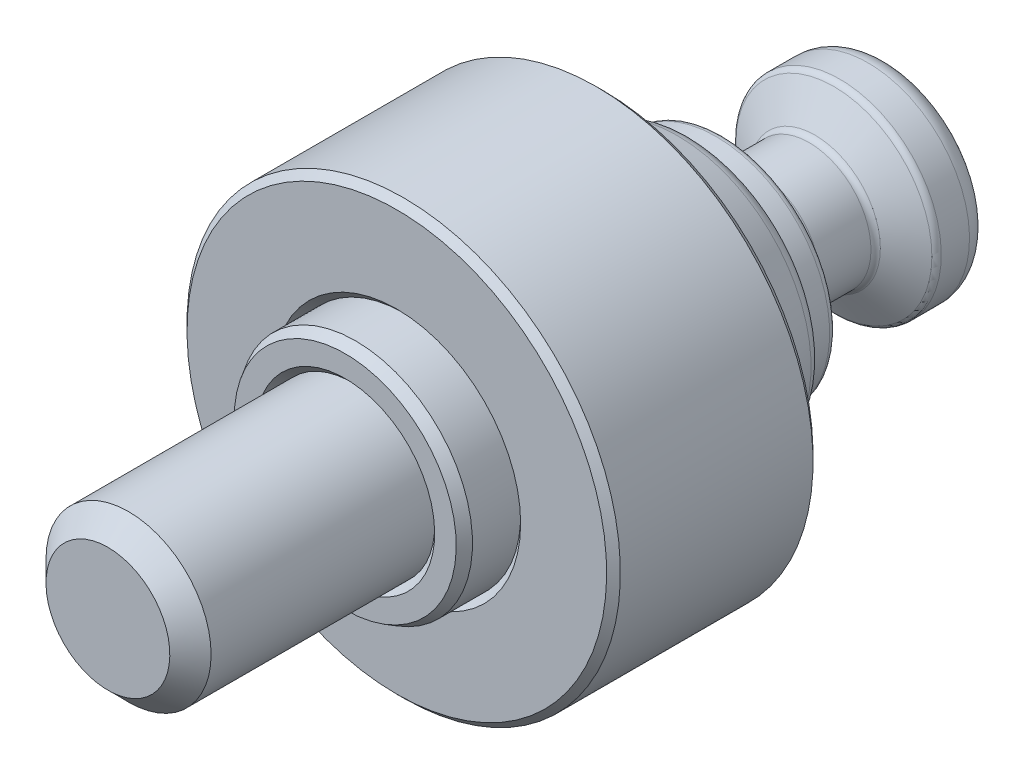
ISO-10303-21;
HEADER;
FILE_DESCRIPTION(('STEP AP214'),'2;1');
FILE_NAME('part.step','',(''),(''),'','','');
FILE_SCHEMA(('AUTOMOTIVE_DESIGN { 1 0 10303 214 1 1 1 1 }'));
ENDSEC;
DATA;
#1=APPLICATION_CONTEXT('core data for automotive mechanical design processes');
#2=APPLICATION_PROTOCOL_DEFINITION('international standard','automotive_design',2000,#1);
#3=PRODUCT_CONTEXT('',#1,'mechanical');
#4=PRODUCT('Part','Part','',(#3));
#5=PRODUCT_RELATED_PRODUCT_CATEGORY('part','',(#4));
#6=PRODUCT_DEFINITION_FORMATION('','',#4);
#7=PRODUCT_DEFINITION_CONTEXT('part definition',#1,'design');
#8=PRODUCT_DEFINITION('design','',#6,#7);
#9=PRODUCT_DEFINITION_SHAPE('','',#8);
#10=(LENGTH_UNIT() NAMED_UNIT(*) SI_UNIT(.MILLI.,.METRE.));
#11=(NAMED_UNIT(*) PLANE_ANGLE_UNIT() SI_UNIT($,.RADIAN.));
#12=(NAMED_UNIT(*) SI_UNIT($,.STERADIAN.) SOLID_ANGLE_UNIT());
#13=UNCERTAINTY_MEASURE_WITH_UNIT(LENGTH_MEASURE(1.E-05),#10,'distance_accuracy_value','');
#14=(GEOMETRIC_REPRESENTATION_CONTEXT(3) GLOBAL_UNCERTAINTY_ASSIGNED_CONTEXT((#13)) GLOBAL_UNIT_ASSIGNED_CONTEXT((#10,
#11,#12)) REPRESENTATION_CONTEXT('',''));
#15=CARTESIAN_POINT('',(0.,0.,0.));
#16=DIRECTION('',(0.,0.,1.));
#17=DIRECTION('',(1.,0.,0.));
#18=AXIS2_PLACEMENT_3D('',#15,#16,#17);
#19=CARTESIAN_POINT('',(0.,0.,-12.8632009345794));
#20=DIRECTION('',(0.,0.,-1.));
#21=DIRECTION('',(0.,1.,0.));
#22=AXIS2_PLACEMENT_3D('',#19,#20,#21);
#23=CYLINDRICAL_SURFACE('',#22,31.5);
#24=CARTESIAN_POINT('',(0.,0.,1.00000000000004));
#25=DIRECTION('',(0.,0.,-1.));
#26=DIRECTION('',(0.,1.,0.));
#27=AXIS2_PLACEMENT_3D('',#24,#25,#26);
#28=CIRCLE('',#27,31.5);
#29=CARTESIAN_POINT('',(0.,31.5,1.00000000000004));
#30=VERTEX_POINT('',#29);
#31=EDGE_CURVE('E421',#30,#30,#28,.F.);
#32=ORIENTED_EDGE('',*,*,#31,.T.);
#33=EDGE_LOOP('',(#32));
#34=FACE_BOUND('',#33,.T.);
#35=CARTESIAN_POINT('',(0.,0.,29.));
#36=DIRECTION('',(0.,0.,1.));
#37=DIRECTION('',(0.,-1.,0.));
#38=AXIS2_PLACEMENT_3D('',#35,#36,#37);
#39=CIRCLE('',#38,31.5);
#40=CARTESIAN_POINT('',(0.,-31.5,29.));
#41=VERTEX_POINT('',#40);
#42=EDGE_CURVE('E417',#41,#41,#39,.F.);
#43=ORIENTED_EDGE('',*,*,#42,.T.);
#44=EDGE_LOOP('',(#43));
#45=FACE_BOUND('',#44,.T.);
#46=ADVANCED_FACE('F14',(#34,#45),#23,.T.);
#47=CARTESIAN_POINT('',(0.,0.,0.));
#48=DIRECTION('',(0.,0.,1.));
#49=DIRECTION('',(0.,-1.,0.));
#50=AXIS2_PLACEMENT_3D('',#47,#48,#49);
#51=CONICAL_SURFACE('',#50,30.5,0.785398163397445);
#52=ORIENTED_EDGE('',*,*,#31,.F.);
#53=EDGE_LOOP('',(#52));
#54=FACE_BOUND('',#53,.T.);
#55=CARTESIAN_POINT('',(0.,0.,0.));
#56=DIRECTION('',(0.,0.,-1.));
#57=DIRECTION('',(0.,1.,0.));
#58=AXIS2_PLACEMENT_3D('',#55,#56,#57);
#59=CIRCLE('',#58,30.5);
#60=CARTESIAN_POINT('',(0.,30.5,0.));
#61=VERTEX_POINT('',#60);
#62=EDGE_CURVE('E376',#61,#61,#59,.T.);
#63=ORIENTED_EDGE('',*,*,#62,.F.);
#64=EDGE_LOOP('',(#63));
#65=FACE_BOUND('',#64,.T.);
#66=ADVANCED_FACE('F313',(#54,#65),#51,.T.);
#67=CARTESIAN_POINT('',(17.,0.,0.));
#68=DIRECTION('',(0.,0.,-1.));
#69=DIRECTION('',(0.,1.,0.));
#70=AXIS2_PLACEMENT_3D('',#67,#68,#69);
#71=PLANE('',#70);
#72=ORIENTED_EDGE('',*,*,#62,.T.);
#73=EDGE_LOOP('',(#72));
#74=FACE_BOUND('',#73,.T.);
#75=CARTESIAN_POINT('',(0.,0.,0.));
#76=DIRECTION('',(0.,0.,1.));
#77=DIRECTION('',(0.,-1.,0.));
#78=AXIS2_PLACEMENT_3D('',#75,#76,#77);
#79=CIRCLE('',#78,21.9);
#80=CARTESIAN_POINT('',(0.,-21.9,0.));
#81=VERTEX_POINT('',#80);
#82=EDGE_CURVE('E9',#81,#81,#79,.T.);
#83=ORIENTED_EDGE('',*,*,#82,.T.);
#84=EDGE_LOOP('',(#83));
#85=FACE_BOUND('',#84,.T.);
#86=ADVANCED_FACE('F320',(#74,#85),#71,.T.);
#87=CARTESIAN_POINT('',(0.,0.,29.));
#88=DIRECTION('',(0.,0.,-1.));
#89=DIRECTION('',(0.,1.,0.));
#90=AXIS2_PLACEMENT_3D('',#87,#88,#89);
#91=CONICAL_SURFACE('',#90,31.5,0.785398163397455);
#92=CARTESIAN_POINT('',(0.,0.,30.));
#93=DIRECTION('',(0.,0.,1.));
#94=DIRECTION('',(0.,-1.,0.));
#95=AXIS2_PLACEMENT_3D('',#92,#93,#94);
#96=CIRCLE('',#95,30.5);
#97=CARTESIAN_POINT('',(0.,-30.5,30.));
#98=VERTEX_POINT('',#97);
#99=EDGE_CURVE('E427',#98,#98,#96,.T.);
#100=ORIENTED_EDGE('',*,*,#99,.F.);
#101=EDGE_LOOP('',(#100));
#102=FACE_BOUND('',#101,.T.);
#103=ORIENTED_EDGE('',*,*,#42,.F.);
#104=EDGE_LOOP('',(#103));
#105=FACE_BOUND('',#104,.T.);
#106=ADVANCED_FACE('F329',(#102,#105),#91,.T.);
#107=CARTESIAN_POINT('',(17.,0.,30.));
#108=DIRECTION('',(0.,0.,1.));
#109=DIRECTION('',(0.,-1.,0.));
#110=AXIS2_PLACEMENT_3D('',#107,#108,#109);
#111=PLANE('',#110);
#112=ORIENTED_EDGE('',*,*,#99,.T.);
#113=EDGE_LOOP('',(#112));
#114=FACE_BOUND('',#113,.T.);
#115=CARTESIAN_POINT('',(0.,0.,30.));
#116=DIRECTION('',(0.,0.,1.));
#117=DIRECTION('',(0.,-1.,0.));
#118=AXIS2_PLACEMENT_3D('',#115,#116,#117);
#119=CIRCLE('',#118,18.);
#120=CARTESIAN_POINT('',(0.,-18.,30.));
#121=VERTEX_POINT('',#120);
#122=EDGE_CURVE('E425',#121,#121,#119,.F.);
#123=ORIENTED_EDGE('',*,*,#122,.T.);
#124=EDGE_LOOP('',(#123));
#125=FACE_BOUND('',#124,.T.);
#126=ADVANCED_FACE('F327',(#114,#125),#111,.T.);
#127=CARTESIAN_POINT('',(0.,0.,30.));
#128=DIRECTION('',(0.,0.,1.));
#129=DIRECTION('',(0.,-1.,0.));
#130=AXIS2_PLACEMENT_3D('',#127,#128,#129);
#131=CONICAL_SURFACE('',#130,18.,0.785398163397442);
#132=CARTESIAN_POINT('',(0.,0.,29.));
#133=DIRECTION('',(0.,0.,1.));
#134=DIRECTION('',(0.,-1.,0.));
#135=AXIS2_PLACEMENT_3D('',#132,#133,#134);
#136=CIRCLE('',#135,17.);
#137=CARTESIAN_POINT('',(0.,-17.,29.));
#138=VERTEX_POINT('',#137);
#139=EDGE_CURVE('E29',#138,#138,#136,.T.);
#140=ORIENTED_EDGE('',*,*,#139,.F.);
#141=EDGE_LOOP('',(#140));
#142=FACE_BOUND('',#141,.T.);
#143=ORIENTED_EDGE('',*,*,#122,.F.);
#144=EDGE_LOOP('',(#143));
#145=FACE_BOUND('',#144,.T.);
#146=ADVANCED_FACE('F194',(#142,#145),#131,.F.);
#147=CARTESIAN_POINT('',(0.,0.,72.));
#148=DIRECTION('',(0.,0.,1.));
#149=DIRECTION('',(0.,1.,0.));
#150=AXIS2_PLACEMENT_3D('',#147,#148,#149);
#151=PLANE('',#150);
#152=CARTESIAN_POINT('',(0.,0.,72.));
#153=DIRECTION('',(0.,0.,1.));
#154=DIRECTION('',(0.,1.,0.));
#155=AXIS2_PLACEMENT_3D('',#152,#153,#154);
#156=CIRCLE('',#155,9.);
#157=CARTESIAN_POINT('',(0.,9.,72.));
#158=VERTEX_POINT('',#157);
#159=EDGE_CURVE('E129',#158,#158,#156,.T.);
#160=ORIENTED_EDGE('',*,*,#159,.T.);
#161=EDGE_LOOP('',(#160));
#162=FACE_BOUND('',#161,.T.);
#163=ADVANCED_FACE('F184',(#162),#151,.T.);
#164=CARTESIAN_POINT('',(0.,0.,69.));
#165=DIRECTION('',(0.,0.,-1.));
#166=DIRECTION('',(0.,-1.,0.));
#167=AXIS2_PLACEMENT_3D('',#164,#165,#166);
#168=CONICAL_SURFACE('',#167,12.,0.785398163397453);
#169=ORIENTED_EDGE('',*,*,#159,.F.);
#170=EDGE_LOOP('',(#169));
#171=FACE_BOUND('',#170,.T.);
#172=CARTESIAN_POINT('',(0.,0.,69.));
#173=DIRECTION('',(0.,0.,1.));
#174=DIRECTION('',(0.,1.,0.));
#175=AXIS2_PLACEMENT_3D('',#172,#173,#174);
#176=CIRCLE('',#175,12.);
#177=CARTESIAN_POINT('',(0.,12.,69.));
#178=VERTEX_POINT('',#177);
#179=EDGE_CURVE('E126',#178,#178,#176,.F.);
#180=ORIENTED_EDGE('',*,*,#179,.F.);
#181=EDGE_LOOP('',(#180));
#182=FACE_BOUND('',#181,.T.);
#183=ADVANCED_FACE('F181',(#171,#182),#168,.T.);
#184=CARTESIAN_POINT('',(0.,0.,-13.));
#185=DIRECTION('',(0.,0.,-1.));
#186=DIRECTION('',(0.,-1.,0.));
#187=AXIS2_PLACEMENT_3D('',#184,#185,#186);
#188=CYLINDRICAL_SURFACE('',#187,12.);
#189=ORIENTED_EDGE('',*,*,#179,.T.);
#190=EDGE_LOOP('',(#189));
#191=FACE_BOUND('',#190,.T.);
#192=CARTESIAN_POINT('',(0.,0.,36.5));
#193=DIRECTION('',(0.,0.,1.));
#194=DIRECTION('',(0.,-1.,0.));
#195=AXIS2_PLACEMENT_3D('',#192,#193,#194);
#196=CIRCLE('',#195,12.);
#197=CARTESIAN_POINT('',(0.,-12.,36.5));
#198=VERTEX_POINT('',#197);
#199=EDGE_CURVE('E371',#198,#198,#196,.T.);
#200=ORIENTED_EDGE('',*,*,#199,.T.);
#201=EDGE_LOOP('',(#200));
#202=FACE_BOUND('',#201,.T.);
#203=ADVANCED_FACE('F170',(#191,#202),#188,.T.);
#204=CARTESIAN_POINT('',(0.,0.,37.5));
#205=DIRECTION('',(0.,0.,1.));
#206=DIRECTION('',(0.,-1.,0.));
#207=AXIS2_PLACEMENT_3D('',#204,#205,#206);
#208=CONICAL_SURFACE('',#207,13.,0.785398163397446);
#209=ORIENTED_EDGE('',*,*,#199,.F.);
#210=EDGE_LOOP('',(#209));
#211=FACE_BOUND('',#210,.T.);
#212=CARTESIAN_POINT('',(0.,0.,37.5));
#213=DIRECTION('',(0.,0.,1.));
#214=DIRECTION('',(0.,-1.,0.));
#215=AXIS2_PLACEMENT_3D('',#212,#213,#214);
#216=CIRCLE('',#215,13.);
#217=CARTESIAN_POINT('',(0.,-13.,37.5));
#218=VERTEX_POINT('',#217);
#219=EDGE_CURVE('E368',#218,#218,#216,.F.);
#220=ORIENTED_EDGE('',*,*,#219,.F.);
#221=EDGE_LOOP('',(#220));
#222=FACE_BOUND('',#221,.T.);
#223=ADVANCED_FACE('F167',(#211,#222),#208,.F.);
#224=CARTESIAN_POINT('',(12.,0.,37.5));
#225=DIRECTION('',(0.,0.,1.));
#226=DIRECTION('',(0.,-1.,0.));
#227=AXIS2_PLACEMENT_3D('',#224,#225,#226);
#228=PLANE('',#227);
#229=ORIENTED_EDGE('',*,*,#219,.T.);
#230=EDGE_LOOP('',(#229));
#231=FACE_BOUND('',#230,.T.);
#232=CARTESIAN_POINT('',(0.,0.,37.5));
#233=DIRECTION('',(0.,0.,1.));
#234=DIRECTION('',(0.,-1.,0.));
#235=AXIS2_PLACEMENT_3D('',#232,#233,#234);
#236=CIRCLE('',#235,16.1339745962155);
#237=CARTESIAN_POINT('',(0.,-16.1339745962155,37.5));
#238=VERTEX_POINT('',#237);
#239=EDGE_CURVE('E365',#238,#238,#236,.T.);
#240=ORIENTED_EDGE('',*,*,#239,.T.);
#241=EDGE_LOOP('',(#240));
#242=FACE_BOUND('',#241,.T.);
#243=ADVANCED_FACE('F169',(#231,#242),#228,.T.);
#244=CARTESIAN_POINT('',(0.,0.,36.));
#245=DIRECTION('',(0.,0.,-1.));
#246=DIRECTION('',(0.,1.,0.));
#247=AXIS2_PLACEMENT_3D('',#244,#245,#246);
#248=CONICAL_SURFACE('',#247,17.,0.523598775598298);
#249=ORIENTED_EDGE('',*,*,#239,.F.);
#250=EDGE_LOOP('',(#249));
#251=FACE_BOUND('',#250,.T.);
#252=CARTESIAN_POINT('',(0.,0.,36.));
#253=DIRECTION('',(0.,0.,1.));
#254=DIRECTION('',(0.,-1.,0.));
#255=AXIS2_PLACEMENT_3D('',#252,#253,#254);
#256=CIRCLE('',#255,17.);
#257=CARTESIAN_POINT('',(0.,-17.,36.));
#258=VERTEX_POINT('',#257);
#259=EDGE_CURVE('E363',#258,#258,#256,.F.);
#260=ORIENTED_EDGE('',*,*,#259,.F.);
#261=EDGE_LOOP('',(#260));
#262=FACE_BOUND('',#261,.T.);
#263=ADVANCED_FACE('F178',(#251,#262),#248,.T.);
#264=CARTESIAN_POINT('',(0.,0.,0.));
#265=DIRECTION('',(0.,0.,-1.));
#266=DIRECTION('',(0.,1.,0.));
#267=AXIS2_PLACEMENT_3D('',#264,#265,#266);
#268=CYLINDRICAL_SURFACE('',#267,17.);
#269=ORIENTED_EDGE('',*,*,#259,.T.);
#270=EDGE_LOOP('',(#269));
#271=FACE_BOUND('',#270,.T.);
#272=ORIENTED_EDGE('',*,*,#139,.T.);
#273=EDGE_LOOP('',(#272));
#274=FACE_BOUND('',#273,.T.);
#275=ADVANCED_FACE('F293',(#271,#274),#268,.T.);
#276=CARTESIAN_POINT('',(0.,0.,-36.));
#277=DIRECTION('',(0.,0.,-1.));
#278=DIRECTION('',(0.,-1.,0.));
#279=AXIS2_PLACEMENT_3D('',#276,#277,#278);
#280=PLANE('',#279);
#281=DIRECTION('',(-0.5,-0.866025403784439,0.));
#282=VECTOR('',#281,1.);
#283=CARTESIAN_POINT('',(4.61880215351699,0.,-36.));
#284=LINE('',#283,#282);
#285=CARTESIAN_POINT('',(4.61880215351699,0.,-36.));
#286=VERTEX_POINT('',#285);
#287=CARTESIAN_POINT('',(2.30940107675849,-4.,-36.));
#288=VERTEX_POINT('',#287);
#289=EDGE_CURVE('E98',#286,#288,#284,.T.);
#290=ORIENTED_EDGE('',*,*,#289,.T.);
#291=DIRECTION('',(-1.,0.,0.));
#292=VECTOR('',#291,1.);
#293=CARTESIAN_POINT('',(2.30940107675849,-4.,-36.));
#294=LINE('',#293,#292);
#295=CARTESIAN_POINT('',(-2.30940107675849,-4.,-36.));
#296=VERTEX_POINT('',#295);
#297=EDGE_CURVE('E94',#288,#296,#294,.T.);
#298=ORIENTED_EDGE('',*,*,#297,.T.);
#299=DIRECTION('',(-0.5,0.866025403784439,0.));
#300=VECTOR('',#299,1.);
#301=CARTESIAN_POINT('',(-2.30940107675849,-4.,-36.));
#302=LINE('',#301,#300);
#303=CARTESIAN_POINT('',(-4.61880215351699,0.,-36.));
#304=VERTEX_POINT('',#303);
#305=EDGE_CURVE('E45',#296,#304,#302,.T.);
#306=ORIENTED_EDGE('',*,*,#305,.T.);
#307=DIRECTION('',(0.5,0.866025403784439,0.));
#308=VECTOR('',#307,1.);
#309=CARTESIAN_POINT('',(-4.61880215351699,0.,-36.));
#310=LINE('',#309,#308);
#311=CARTESIAN_POINT('',(-2.30940107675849,4.,-36.));
#312=VERTEX_POINT('',#311);
#313=EDGE_CURVE('E92',#304,#312,#310,.T.);
#314=ORIENTED_EDGE('',*,*,#313,.T.);
#315=DIRECTION('',(1.,0.,0.));
#316=VECTOR('',#315,1.);
#317=CARTESIAN_POINT('',(-2.30940107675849,4.,-36.));
#318=LINE('',#317,#316);
#319=CARTESIAN_POINT('',(2.3094010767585,4.,-36.));
#320=VERTEX_POINT('',#319);
#321=EDGE_CURVE('E399',#312,#320,#318,.T.);
#322=ORIENTED_EDGE('',*,*,#321,.T.);
#323=DIRECTION('',(0.5,-0.866025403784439,0.));
#324=VECTOR('',#323,1.);
#325=CARTESIAN_POINT('',(2.3094010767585,4.,-36.));
#326=LINE('',#325,#324);
#327=EDGE_CURVE('E397',#320,#286,#326,.T.);
#328=ORIENTED_EDGE('',*,*,#327,.T.);
#329=EDGE_LOOP('',(#290,#298,#306,#314,#322,#328));
#330=FACE_BOUND('',#329,.T.);
#331=ADVANCED_FACE('F162',(#330),#280,.T.);
#332=CARTESIAN_POINT('',(-4.61880215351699,0.,-36.));
#333=DIRECTION('',(-0.866025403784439,0.5,0.));
#334=DIRECTION('',(-0.5,-0.866025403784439,0.));
#335=AXIS2_PLACEMENT_3D('',#332,#333,#334);
#336=PLANE('',#335);
#337=CARTESIAN_POINT('',(-2.30928560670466,4.0002,-41.2799819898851));
#338=CARTESIAN_POINT('',(-2.41077174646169,3.82442084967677,-41.2213676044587));
#339=CARTESIAN_POINT('',(-2.51313390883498,3.64712438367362,-41.1680600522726));
#340=CARTESIAN_POINT('',(-2.7196307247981,3.28946140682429,-41.0750114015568));
#341=CARTESIAN_POINT('',(-2.82376904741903,3.10908854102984,-41.0353032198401));
#342=CARTESIAN_POINT('',(-3.03075510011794,2.7505781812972,-40.9734919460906));
#343=CARTESIAN_POINT('',(-3.13357098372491,2.57249584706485,-40.9509774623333));
#344=CARTESIAN_POINT('',(-3.33968651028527,2.21549328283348,-40.9241003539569));
#345=CARTESIAN_POINT('',(-3.44298540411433,2.03657435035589,-40.9197154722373));
#346=CARTESIAN_POINT('',(-3.63600352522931,1.70225715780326,-40.9288398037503));
#347=CARTESIAN_POINT('',(-3.72575165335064,1.54680884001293,-40.9401086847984));
#348=CARTESIAN_POINT('',(-3.90466320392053,1.23692494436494,-40.9758237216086));
#349=CARTESIAN_POINT('',(-3.99382600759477,1.08249043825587,-41.0002820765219));
#350=CARTESIAN_POINT('',(-4.17310641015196,0.77196767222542,-41.0614257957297));
#351=CARTESIAN_POINT('',(-4.2632013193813,0.615918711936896,-41.0983703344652));
#352=CARTESIAN_POINT('',(-4.44204742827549,0.30614816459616,-41.1822198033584));
#353=CARTESIAN_POINT('',(-4.53080091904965,0.152422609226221,-41.2291050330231));
#354=CARTESIAN_POINT('',(-4.61891762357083,-0.00019999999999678,-41.2799819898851));
#355=B_SPLINE_CURVE_WITH_KNOTS('',3,(#337,#338,#339,#340,#341,#342,#343,#344,#345,#346,#347,
#348,#349,#350,#351,#352,#353,#354),.UNSPECIFIED.,.F.,.F.,(4,2,2,2,2,2,2,2,4),(0.,
0.634047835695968,1.26961969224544,1.88946157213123,2.50854226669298,3.04757825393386,
3.58711366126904,4.13861653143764,4.68903648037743),.UNSPECIFIED.);
#356=CARTESIAN_POINT('',(-2.30940107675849,4.,-41.2799153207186));
#357=VERTEX_POINT('',#356);
#358=CARTESIAN_POINT('',(-4.61880215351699,0.,-41.2799153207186));
#359=VERTEX_POINT('',#358);
#360=EDGE_CURVE('E18',#357,#359,#355,.T.);
#361=ORIENTED_EDGE('',*,*,#360,.F.);
#362=DIRECTION('',(0.,0.,-1.));
#363=VECTOR('',#362,1.);
#364=CARTESIAN_POINT('',(-2.30940107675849,4.,-36.));
#365=LINE('',#364,#363);
#366=EDGE_CURVE('E93',#312,#357,#365,.T.);
#367=ORIENTED_EDGE('',*,*,#366,.F.);
#368=ORIENTED_EDGE('',*,*,#313,.F.);
#369=DIRECTION('',(0.,0.,-1.));
#370=VECTOR('',#369,1.);
#371=CARTESIAN_POINT('',(-4.61880215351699,0.,-36.));
#372=LINE('',#371,#370);
#373=EDGE_CURVE('E85',#304,#359,#372,.T.);
#374=ORIENTED_EDGE('',*,*,#373,.T.);
#375=EDGE_LOOP('',(#361,#367,#368,#374));
#376=FACE_BOUND('',#375,.T.);
#377=ADVANCED_FACE('F90',(#376),#336,.F.);
#378=CARTESIAN_POINT('',(-2.30940107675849,4.,-36.));
#379=DIRECTION('',(0.,1.,0.));
#380=DIRECTION('',(-1.,0.,0.));
#381=AXIS2_PLACEMENT_3D('',#378,#379,#380);
#382=PLANE('',#381);
#383=CARTESIAN_POINT('',(6.11536351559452,4.,-42.8321612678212));
#384=CARTESIAN_POINT('',(5.94136455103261,4.,-42.7481138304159));
#385=CARTESIAN_POINT('',(5.7669565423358,4.,-42.6648982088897));
#386=CARTESIAN_POINT('',(5.41710453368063,4.,-42.5006003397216));
#387=CARTESIAN_POINT('',(5.24166036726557,4.,-42.4195184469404));
#388=CARTESIAN_POINT('',(4.88857129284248,4.,-42.2595308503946));
#389=CARTESIAN_POINT('',(4.71091953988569,4.,-42.1806401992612));
#390=CARTESIAN_POINT('',(4.3541717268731,4.,-42.0262076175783));
#391=CARTESIAN_POINT('',(4.17507573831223,4.,-41.9506655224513));
#392=CARTESIAN_POINT('',(3.80974659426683,4.,-41.8016107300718));
#393=CARTESIAN_POINT('',(3.62346053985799,4.,-41.7282269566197));
#394=CARTESIAN_POINT('',(3.24867678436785,4.,-41.5872295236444));
#395=CARTESIAN_POINT('',(3.06017883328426,4.,-41.5196165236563));
#396=CARTESIAN_POINT('',(2.68105362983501,4.,-41.3920002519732));
#397=CARTESIAN_POINT('',(2.49043188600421,4.,-41.331980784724));
#398=CARTESIAN_POINT('',(2.10645638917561,4.,-41.2215351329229));
#399=CARTESIAN_POINT('',(1.91310354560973,4.,-41.1711058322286));
#400=CARTESIAN_POINT('',(1.52459990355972,4.,-41.0825776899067));
#401=CARTESIAN_POINT('',(1.32946366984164,4.,-41.0444161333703));
#402=CARTESIAN_POINT('',(0.936859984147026,4.,-40.9826444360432));
#403=CARTESIAN_POINT('',(0.739392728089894,4.,-40.9590330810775));
#404=CARTESIAN_POINT('',(0.345654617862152,4.,-40.9285556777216));
#405=CARTESIAN_POINT('',(0.149400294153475,4.,-40.9214813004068));
#406=CARTESIAN_POINT('',(-0.243008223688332,4.,-40.9241343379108));
#407=CARTESIAN_POINT('',(-0.43916241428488,4.,-40.9338623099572));
#408=CARTESIAN_POINT('',(-0.774833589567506,4.,-40.9642118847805));
#409=CARTESIAN_POINT('',(-0.914717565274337,4.,-40.9809861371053));
#410=CARTESIAN_POINT('',(-1.1933968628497,4.,-41.0219863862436));
#411=CARTESIAN_POINT('',(-1.33219202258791,4.,-41.0462134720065));
#412=CARTESIAN_POINT('',(-1.74679493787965,4.,-41.1287935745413));
#413=CARTESIAN_POINT('',(-2.02065290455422,4.,-41.1970283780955));
#414=CARTESIAN_POINT('',(-2.43006674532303,4.,-41.314532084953));
#415=CARTESIAN_POINT('',(-2.56776398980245,4.,-41.3567577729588));
#416=CARTESIAN_POINT('',(-2.84181962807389,4.,-41.4453888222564));
#417=CARTESIAN_POINT('',(-2.97817801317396,4.,-41.4917942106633));
#418=CARTESIAN_POINT('',(-3.24960349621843,4.,-41.5880571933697));
#419=CARTESIAN_POINT('',(-3.38467104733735,4.,-41.6379135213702));
#420=CARTESIAN_POINT('',(-3.65370081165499,4.,-41.7405124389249));
#421=CARTESIAN_POINT('',(-3.78766303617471,4.,-41.7932549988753));
#422=CARTESIAN_POINT('',(-4.09701986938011,4.,-41.9182840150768));
#423=CARTESIAN_POINT('',(-4.27205588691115,4.,-41.991455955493));
#424=CARTESIAN_POINT('',(-4.62071132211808,4.,-42.141108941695));
#425=CARTESIAN_POINT('',(-4.79433066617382,4.,-42.2175901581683));
#426=CARTESIAN_POINT('',(-5.14040670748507,4.,-42.373213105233));
#427=CARTESIAN_POINT('',(-5.31286319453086,4.,-42.4523553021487));
#428=CARTESIAN_POINT('',(-5.65677659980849,4.,-42.6127855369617));
#429=CARTESIAN_POINT('',(-5.82823349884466,4.,-42.6940736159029));
#430=CARTESIAN_POINT('',(-6.34165551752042,4.,-42.9406928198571));
#431=CARTESIAN_POINT('',(-6.6823640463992,4.,-43.1086386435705));
#432=CARTESIAN_POINT('',(-7.36139047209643,4.,-43.4492937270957));
#433=CARTESIAN_POINT('',(-7.69970828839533,4.,-43.6220031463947));
#434=CARTESIAN_POINT('',(-8.34749653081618,4.,-43.9568309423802));
#435=CARTESIAN_POINT('',(-8.65710289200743,4.,-44.1186868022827));
#436=CARTESIAN_POINT('',(-9.27517825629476,4.,-44.4445752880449));
#437=CARTESIAN_POINT('',(-9.58364722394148,4.,-44.6086079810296));
#438=CARTESIAN_POINT('',(-10.1989977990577,4.,-44.937968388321));
#439=CARTESIAN_POINT('',(-10.5058814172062,4.,-45.1032923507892));
#440=CARTESIAN_POINT('',(-11.11891782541,4.,-45.4352539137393));
#441=CARTESIAN_POINT('',(-11.4250706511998,4.,-45.6018914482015));
#442=CARTESIAN_POINT('',(-11.7309525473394,4.,-45.7690213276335));
#443=B_SPLINE_CURVE_WITH_KNOTS('',3,(#383,#384,#385,#386,#387,#388,#389,#390,#391,#392,#393,
#394,#395,#396,#397,#398,#399,#400,#401,#402,#403,#404,#405,#406,#407,#408,#409,#410,#411,#412,
#413,#414,#415,#416,#417,#418,#419,#420,#421,#422,#423,#424,#425,#426,#427,#428,#429,#430,#431,
#432,#433,#434,#435,#436,#437,#438,#439,#440,#441,#442),.UNSPECIFIED.,.F.,.F.,(4,2,2,2,2,2,2,2,
2,2,2,2,2,2,2,2,2,2,2,2,2,2,2,2,2,2,2,2,2,4),(0.,0.579711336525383,1.15951848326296,
1.74263314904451,2.32571912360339,2.92630247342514,3.52695437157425,4.12630278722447,
4.72545612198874,5.32149588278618,5.91748589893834,6.50592633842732,7.09438629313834,
7.51683805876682,7.93935157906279,8.78488063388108,9.2169253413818,9.64897285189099,
10.0808626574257,10.5127480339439,11.0818474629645,11.6509762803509,12.2202053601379,
12.7894453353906,13.9289401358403,15.0684731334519,16.1165460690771,17.1646513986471,
18.2103945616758,19.2560854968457),.UNSPECIFIED.);
#444=CARTESIAN_POINT('',(2.3094010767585,4.,-41.2799153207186));
#445=VERTEX_POINT('',#444);
#446=EDGE_CURVE('E37',#445,#357,#443,.T.);
#447=ORIENTED_EDGE('',*,*,#446,.F.);
#448=DIRECTION('',(0.,0.,-1.));
#449=VECTOR('',#448,1.);
#450=CARTESIAN_POINT('',(2.3094010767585,4.,-36.));
#451=LINE('',#450,#449);
#452=EDGE_CURVE('E96',#320,#445,#451,.T.);
#453=ORIENTED_EDGE('',*,*,#452,.F.);
#454=ORIENTED_EDGE('',*,*,#321,.F.);
#455=ORIENTED_EDGE('',*,*,#366,.T.);
#456=EDGE_LOOP('',(#447,#453,#454,#455));
#457=FACE_BOUND('',#456,.T.);
#458=ADVANCED_FACE('F246',(#457),#382,.F.);
#459=CARTESIAN_POINT('',(2.3094010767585,4.,-36.));
#460=DIRECTION('',(0.866025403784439,0.5,0.));
#461=DIRECTION('',(-0.5,0.866025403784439,0.));
#462=AXIS2_PLACEMENT_3D('',#459,#460,#461);
#463=PLANE('',#462);
#464=CARTESIAN_POINT('',(4.61891762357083,-0.000200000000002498,-41.2799819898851));
#465=CARTESIAN_POINT('',(4.5174314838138,0.175579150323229,-41.2213676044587));
#466=CARTESIAN_POINT('',(4.41506932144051,0.352875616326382,-41.1680600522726));
#467=CARTESIAN_POINT('',(4.20857250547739,0.710538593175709,-41.0750114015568));
#468=CARTESIAN_POINT('',(4.10443418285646,0.890911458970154,-41.0353032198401));
#469=CARTESIAN_POINT('',(3.89744813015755,1.24942181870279,-40.9734919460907));
#470=CARTESIAN_POINT('',(3.79463224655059,1.42750415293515,-40.9509774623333));
#471=CARTESIAN_POINT('',(3.58851671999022,1.78450671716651,-40.924100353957));
#472=CARTESIAN_POINT('',(3.48521782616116,1.9634256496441,-40.9197154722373));
#473=CARTESIAN_POINT('',(3.29219970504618,2.29774284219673,-40.9288398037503));
#474=CARTESIAN_POINT('',(3.20245157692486,2.45319115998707,-40.9401086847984));
#475=CARTESIAN_POINT('',(3.02354002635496,2.76307505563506,-40.9758237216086));
#476=CARTESIAN_POINT('',(2.93437722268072,2.91750956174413,-41.0002820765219));
#477=CARTESIAN_POINT('',(2.75509682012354,3.22803232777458,-41.0614257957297));
#478=CARTESIAN_POINT('',(2.66500191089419,3.3840812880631,-41.0983703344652));
#479=CARTESIAN_POINT('',(2.486155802,3.69385183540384,-41.1822198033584));
#480=CARTESIAN_POINT('',(2.39740231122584,3.84757739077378,-41.2291050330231));
#481=CARTESIAN_POINT('',(2.30928560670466,4.0002,-41.2799819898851));
#482=B_SPLINE_CURVE_WITH_KNOTS('',3,(#464,#465,#466,#467,#468,#469,#470,#471,#472,#473,#474,
#475,#476,#477,#478,#479,#480,#481),.UNSPECIFIED.,.F.,.F.,(4,2,2,2,2,2,2,2,4),(0.,
0.634047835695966,1.26961969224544,1.88946157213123,2.50854226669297,3.04757825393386,
3.58711366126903,4.13861653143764,4.68903648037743),.UNSPECIFIED.);
#483=CARTESIAN_POINT('',(4.61880215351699,0.,-41.2799153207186));
#484=VERTEX_POINT('',#483);
#485=EDGE_CURVE('E211',#484,#445,#482,.T.);
#486=ORIENTED_EDGE('',*,*,#485,.F.);
#487=DIRECTION('',(0.,0.,-1.));
#488=VECTOR('',#487,1.);
#489=CARTESIAN_POINT('',(4.61880215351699,0.,-36.));
#490=LINE('',#489,#488);
#491=EDGE_CURVE('E387',#286,#484,#490,.T.);
#492=ORIENTED_EDGE('',*,*,#491,.F.);
#493=ORIENTED_EDGE('',*,*,#327,.F.);
#494=ORIENTED_EDGE('',*,*,#452,.T.);
#495=EDGE_LOOP('',(#486,#492,#493,#494));
#496=FACE_BOUND('',#495,.T.);
#497=ADVANCED_FACE('F242',(#496),#463,.F.);
#498=CARTESIAN_POINT('',(4.61880215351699,0.,-36.));
#499=DIRECTION('',(0.866025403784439,-0.5,0.));
#500=DIRECTION('',(0.5,0.866025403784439,0.));
#501=AXIS2_PLACEMENT_3D('',#498,#499,#500);
#502=PLANE('',#501);
#503=CARTESIAN_POINT('',(2.30928560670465,-4.0002,-41.2799819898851));
#504=CARTESIAN_POINT('',(2.41077174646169,-3.82442084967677,-41.2213676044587));
#505=CARTESIAN_POINT('',(2.51313390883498,-3.64712438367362,-41.1680600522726));
#506=CARTESIAN_POINT('',(2.7196307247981,-3.28946140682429,-41.0750114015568));
#507=CARTESIAN_POINT('',(2.82376904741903,-3.10908854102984,-41.0353032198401));
#508=CARTESIAN_POINT('',(3.03075510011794,-2.7505781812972,-40.9734919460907));
#509=CARTESIAN_POINT('',(3.1335709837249,-2.57249584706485,-40.9509774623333));
#510=CARTESIAN_POINT('',(3.33968651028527,-2.21549328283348,-40.924100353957));
#511=CARTESIAN_POINT('',(3.44298540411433,-2.03657435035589,-40.9197154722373));
#512=CARTESIAN_POINT('',(3.63600352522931,-1.70225715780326,-40.9288398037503));
#513=CARTESIAN_POINT('',(3.72575165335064,-1.54680884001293,-40.9401086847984));
#514=CARTESIAN_POINT('',(3.90466320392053,-1.23692494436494,-40.9758237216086));
#515=CARTESIAN_POINT('',(3.99382600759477,-1.08249043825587,-41.0002820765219));
#516=CARTESIAN_POINT('',(4.17310641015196,-0.77196767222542,-41.0614257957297));
#517=CARTESIAN_POINT('',(4.2632013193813,-0.615918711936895,-41.0983703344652));
#518=CARTESIAN_POINT('',(4.44204742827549,-0.306148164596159,-41.1822198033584));
#519=CARTESIAN_POINT('',(4.53080091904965,-0.15242260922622,-41.2291050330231));
#520=CARTESIAN_POINT('',(4.61891762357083,0.000199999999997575,-41.2799819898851));
#521=B_SPLINE_CURVE_WITH_KNOTS('',3,(#503,#504,#505,#506,#507,#508,#509,#510,#511,#512,#513,
#514,#515,#516,#517,#518,#519,#520),.UNSPECIFIED.,.F.,.F.,(4,2,2,2,2,2,2,2,4),(0.,
0.634047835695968,1.26961969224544,1.88946157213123,2.50854226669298,3.04757825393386,
3.58711366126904,4.13861653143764,4.68903648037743),.UNSPECIFIED.);
#522=CARTESIAN_POINT('',(2.30940107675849,-4.,-41.2799153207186));
#523=VERTEX_POINT('',#522);
#524=EDGE_CURVE('E218',#523,#484,#521,.T.);
#525=ORIENTED_EDGE('',*,*,#524,.F.);
#526=DIRECTION('',(0.,0.,-1.));
#527=VECTOR('',#526,1.);
#528=CARTESIAN_POINT('',(2.30940107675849,-4.,-36.));
#529=LINE('',#528,#527);
#530=EDGE_CURVE('E391',#288,#523,#529,.T.);
#531=ORIENTED_EDGE('',*,*,#530,.F.);
#532=ORIENTED_EDGE('',*,*,#289,.F.);
#533=ORIENTED_EDGE('',*,*,#491,.T.);
#534=EDGE_LOOP('',(#525,#531,#532,#533));
#535=FACE_BOUND('',#534,.T.);
#536=ADVANCED_FACE('F238',(#535),#502,.F.);
#537=CARTESIAN_POINT('',(2.30940107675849,-4.,-36.));
#538=DIRECTION('',(0.,-1.,0.));
#539=DIRECTION('',(1.,0.,0.));
#540=AXIS2_PLACEMENT_3D('',#537,#538,#539);
#541=PLANE('',#540);
#542=CARTESIAN_POINT('',(6.11536351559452,-4.,-42.8321612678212));
#543=CARTESIAN_POINT('',(5.94136455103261,-4.,-42.7481138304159));
#544=CARTESIAN_POINT('',(5.7669565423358,-4.,-42.6648982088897));
#545=CARTESIAN_POINT('',(5.41710453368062,-4.,-42.5006003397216));
#546=CARTESIAN_POINT('',(5.24166036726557,-4.,-42.4195184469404));
#547=CARTESIAN_POINT('',(4.88857129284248,-4.,-42.2595308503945));
#548=CARTESIAN_POINT('',(4.71091953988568,-4.,-42.1806401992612));
#549=CARTESIAN_POINT('',(4.3541717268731,-4.,-42.0262076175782));
#550=CARTESIAN_POINT('',(4.17507573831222,-4.,-41.9506655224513));
#551=CARTESIAN_POINT('',(3.80974659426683,-4.,-41.8016107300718));
#552=CARTESIAN_POINT('',(3.62346053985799,-4.,-41.7282269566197));
#553=CARTESIAN_POINT('',(3.24867678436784,-4.,-41.5872295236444));
#554=CARTESIAN_POINT('',(3.06017883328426,-4.,-41.5196165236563));
#555=CARTESIAN_POINT('',(2.681053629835,-4.,-41.3920002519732));
#556=CARTESIAN_POINT('',(2.4904318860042,-4.,-41.331980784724));
#557=CARTESIAN_POINT('',(2.1064563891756,-4.,-41.2215351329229));
#558=CARTESIAN_POINT('',(1.91310354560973,-4.,-41.1711058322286));
#559=CARTESIAN_POINT('',(1.52459990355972,-4.,-41.0825776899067));
#560=CARTESIAN_POINT('',(1.32946366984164,-4.,-41.0444161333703));
#561=CARTESIAN_POINT('',(0.936859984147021,-4.,-40.9826444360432));
#562=CARTESIAN_POINT('',(0.73939272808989,-4.,-40.9590330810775));
#563=CARTESIAN_POINT('',(0.345654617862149,-4.,-40.9285556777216));
#564=CARTESIAN_POINT('',(0.149400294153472,-4.,-40.9214813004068));
#565=CARTESIAN_POINT('',(-0.243008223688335,-4.,-40.9241343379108));
#566=CARTESIAN_POINT('',(-0.439162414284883,-4.,-40.9338623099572));
#567=CARTESIAN_POINT('',(-0.774833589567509,-4.,-40.9642118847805));
#568=CARTESIAN_POINT('',(-0.914717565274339,-4.,-40.9809861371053));
#569=CARTESIAN_POINT('',(-1.1933968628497,-4.,-41.0219863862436));
#570=CARTESIAN_POINT('',(-1.33219202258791,-4.,-41.0462134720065));
#571=CARTESIAN_POINT('',(-1.74679493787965,-4.,-41.1287935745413));
#572=CARTESIAN_POINT('',(-2.02065290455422,-4.,-41.1970283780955));
#573=CARTESIAN_POINT('',(-2.43006674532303,-4.,-41.314532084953));
#574=CARTESIAN_POINT('',(-2.56776398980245,-4.,-41.3567577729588));
#575=CARTESIAN_POINT('',(-2.84181962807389,-4.,-41.4453888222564));
#576=CARTESIAN_POINT('',(-2.97817801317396,-4.,-41.4917942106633));
#577=CARTESIAN_POINT('',(-3.24960349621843,-4.,-41.5880571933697));
#578=CARTESIAN_POINT('',(-3.38467104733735,-4.,-41.6379135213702));
#579=CARTESIAN_POINT('',(-3.65370081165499,-4.,-41.7405124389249));
#580=CARTESIAN_POINT('',(-3.78766303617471,-4.,-41.7932549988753));
#581=CARTESIAN_POINT('',(-4.09701986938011,-4.,-41.9182840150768));
#582=CARTESIAN_POINT('',(-4.27205588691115,-4.,-41.991455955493));
#583=CARTESIAN_POINT('',(-4.62071132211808,-4.,-42.141108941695));
#584=CARTESIAN_POINT('',(-4.79433066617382,-4.,-42.2175901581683));
#585=CARTESIAN_POINT('',(-5.14040670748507,-4.,-42.373213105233));
#586=CARTESIAN_POINT('',(-5.31286319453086,-4.,-42.4523553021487));
#587=CARTESIAN_POINT('',(-5.65677659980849,-4.,-42.6127855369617));
#588=CARTESIAN_POINT('',(-5.82823349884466,-4.,-42.6940736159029));
#589=CARTESIAN_POINT('',(-6.34165551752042,-4.,-42.9406928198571));
#590=CARTESIAN_POINT('',(-6.6823640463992,-4.,-43.1086386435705));
#591=CARTESIAN_POINT('',(-7.36139047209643,-4.,-43.4492937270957));
#592=CARTESIAN_POINT('',(-7.69970828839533,-4.,-43.6220031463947));
#593=CARTESIAN_POINT('',(-8.34749653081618,-4.,-43.9568309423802));
#594=CARTESIAN_POINT('',(-8.65710289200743,-4.,-44.1186868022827));
#595=CARTESIAN_POINT('',(-9.27517825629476,-4.,-44.4445752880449));
#596=CARTESIAN_POINT('',(-9.58364722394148,-4.,-44.6086079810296));
#597=CARTESIAN_POINT('',(-10.1989977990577,-4.,-44.937968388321));
#598=CARTESIAN_POINT('',(-10.5058814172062,-4.,-45.1032923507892));
#599=CARTESIAN_POINT('',(-11.11891782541,-4.,-45.4352539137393));
#600=CARTESIAN_POINT('',(-11.4250706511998,-4.,-45.6018914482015));
#601=CARTESIAN_POINT('',(-11.7309525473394,-4.,-45.7690213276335));
#602=B_SPLINE_CURVE_WITH_KNOTS('',3,(#542,#543,#544,#545,#546,#547,#548,#549,#550,#551,#552,
#553,#554,#555,#556,#557,#558,#559,#560,#561,#562,#563,#564,#565,#566,#567,#568,#569,#570,#571,
#572,#573,#574,#575,#576,#577,#578,#579,#580,#581,#582,#583,#584,#585,#586,#587,#588,#589,#590,
#591,#592,#593,#594,#595,#596,#597,#598,#599,#600,#601),.UNSPECIFIED.,.F.,.F.,(4,2,2,2,2,2,2,2,
2,2,2,2,2,2,2,2,2,2,2,2,2,2,2,2,2,2,2,2,2,4),(0.,0.579711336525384,1.15951848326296,
1.74263314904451,2.3257191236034,2.92630247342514,3.52695437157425,4.12630278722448,
4.72545612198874,5.32149588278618,5.91748589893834,6.50592633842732,7.09438629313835,
7.51683805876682,7.93935157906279,8.78488063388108,9.2169253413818,9.64897285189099,
10.0808626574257,10.5127480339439,11.0818474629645,11.6509762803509,12.2202053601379,
12.7894453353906,13.9289401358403,15.0684731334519,16.1165460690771,17.1646513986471,
18.2103945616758,19.2560854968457),.UNSPECIFIED.);
#603=CARTESIAN_POINT('',(-2.30940107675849,-4.,-41.2799153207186));
#604=VERTEX_POINT('',#603);
#605=EDGE_CURVE('E88',#604,#523,#602,.F.);
#606=ORIENTED_EDGE('',*,*,#605,.F.);
#607=DIRECTION('',(0.,0.,-1.));
#608=VECTOR('',#607,1.);
#609=CARTESIAN_POINT('',(-2.30940107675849,-4.,-36.));
#610=LINE('',#609,#608);
#611=EDGE_CURVE('E87',#296,#604,#610,.T.);
#612=ORIENTED_EDGE('',*,*,#611,.F.);
#613=ORIENTED_EDGE('',*,*,#297,.F.);
#614=ORIENTED_EDGE('',*,*,#530,.T.);
#615=EDGE_LOOP('',(#606,#612,#613,#614));
#616=FACE_BOUND('',#615,.T.);
#617=ADVANCED_FACE('F235',(#616),#541,.F.);
#618=CARTESIAN_POINT('',(-2.30940107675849,-4.,-36.));
#619=DIRECTION('',(-0.866025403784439,-0.5,0.));
#620=DIRECTION('',(0.5,-0.866025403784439,0.));
#621=AXIS2_PLACEMENT_3D('',#618,#619,#620);
#622=PLANE('',#621);
#623=CARTESIAN_POINT('',(-4.61891762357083,0.000200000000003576,-41.2799819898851));
#624=CARTESIAN_POINT('',(-4.5174314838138,-0.175579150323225,-41.2213676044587));
#625=CARTESIAN_POINT('',(-4.41506932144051,-0.352875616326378,-41.1680600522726));
#626=CARTESIAN_POINT('',(-4.20857250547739,-0.710538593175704,-41.0750114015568));
#627=CARTESIAN_POINT('',(-4.10443418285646,-0.890911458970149,-41.0353032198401));
#628=CARTESIAN_POINT('',(-3.89744813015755,-1.24942181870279,-40.9734919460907));
#629=CARTESIAN_POINT('',(-3.79463224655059,-1.42750415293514,-40.9509774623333));
#630=CARTESIAN_POINT('',(-3.58851671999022,-1.78450671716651,-40.924100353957));
#631=CARTESIAN_POINT('',(-3.48521782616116,-1.9634256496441,-40.9197154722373));
#632=CARTESIAN_POINT('',(-3.29219970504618,-2.29774284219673,-40.9288398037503));
#633=CARTESIAN_POINT('',(-3.20245157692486,-2.45319115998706,-40.9401086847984));
#634=CARTESIAN_POINT('',(-3.02354002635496,-2.76307505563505,-40.9758237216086));
#635=CARTESIAN_POINT('',(-2.93437722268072,-2.91750956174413,-41.0002820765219));
#636=CARTESIAN_POINT('',(-2.75509682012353,-3.22803232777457,-41.0614257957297));
#637=CARTESIAN_POINT('',(-2.66500191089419,-3.3840812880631,-41.0983703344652));
#638=CARTESIAN_POINT('',(-2.486155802,-3.69385183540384,-41.1822198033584));
#639=CARTESIAN_POINT('',(-2.39740231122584,-3.84757739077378,-41.2291050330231));
#640=CARTESIAN_POINT('',(-2.30928560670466,-4.0002,-41.2799819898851));
#641=B_SPLINE_CURVE_WITH_KNOTS('',3,(#623,#624,#625,#626,#627,#628,#629,#630,#631,#632,#633,
#634,#635,#636,#637,#638,#639,#640),.UNSPECIFIED.,.F.,.F.,(4,2,2,2,2,2,2,2,4),(0.,
0.634047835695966,1.26961969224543,1.88946157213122,2.50854226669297,3.04757825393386,
3.58711366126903,4.13861653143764,4.68903648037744),.UNSPECIFIED.);
#642=EDGE_CURVE('E76',#359,#604,#641,.T.);
#643=ORIENTED_EDGE('',*,*,#642,.F.);
#644=ORIENTED_EDGE('',*,*,#373,.F.);
#645=ORIENTED_EDGE('',*,*,#305,.F.);
#646=ORIENTED_EDGE('',*,*,#611,.T.);
#647=EDGE_LOOP('',(#643,#644,#645,#646));
#648=FACE_BOUND('',#647,.T.);
#649=ADVANCED_FACE('F84',(#648),#622,.F.);
#650=CARTESIAN_POINT('',(0.,0.,-41.5));
#651=DIRECTION('',(0.,0.,-1.));
#652=DIRECTION('',(-1.,0.,0.));
#653=AXIS2_PLACEMENT_3D('',#650,#651,#652);
#654=CONICAL_SURFACE('',#653,5.,1.0471975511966);
#655=CARTESIAN_POINT('',(0.,0.,-41.5));
#656=DIRECTION('',(0.,0.,1.));
#657=DIRECTION('',(1.,0.,0.));
#658=AXIS2_PLACEMENT_3D('',#655,#656,#657);
#659=CIRCLE('',#658,5.);
#660=CARTESIAN_POINT('',(5.,0.,-41.5));
#661=VERTEX_POINT('',#660);
#662=EDGE_CURVE('E377',#661,#661,#659,.T.);
#663=ORIENTED_EDGE('',*,*,#662,.F.);
#664=EDGE_LOOP('',(#663));
#665=FACE_BOUND('',#664,.T.);
#666=ORIENTED_EDGE('',*,*,#642,.T.);
#667=ORIENTED_EDGE('',*,*,#605,.T.);
#668=ORIENTED_EDGE('',*,*,#524,.T.);
#669=ORIENTED_EDGE('',*,*,#485,.T.);
#670=ORIENTED_EDGE('',*,*,#446,.T.);
#671=ORIENTED_EDGE('',*,*,#360,.T.);
#672=EDGE_LOOP('',(#666,#667,#668,#669,#670,#671));
#673=FACE_BOUND('',#672,.T.);
#674=ADVANCED_FACE('F75',(#665,#673),#654,.F.);
#675=CARTESIAN_POINT('',(-16.5,0.,-41.5));
#676=DIRECTION('',(0.,0.,-1.));
#677=DIRECTION('',(0.,-1.,0.));
#678=AXIS2_PLACEMENT_3D('',#675,#676,#677);
#679=PLANE('',#678);
#680=ORIENTED_EDGE('',*,*,#662,.T.);
#681=EDGE_LOOP('',(#680));
#682=FACE_BOUND('',#681,.T.);
#683=CARTESIAN_POINT('',(0.,0.,-41.5));
#684=DIRECTION('',(0.,0.,-1.));
#685=DIRECTION('',(0.,-1.,0.));
#686=AXIS2_PLACEMENT_3D('',#683,#684,#685);
#687=CIRCLE('',#686,11.75);
#688=CARTESIAN_POINT('',(0.,-11.75,-41.5));
#689=VERTEX_POINT('',#688);
#690=EDGE_CURVE('E117',#689,#689,#687,.T.);
#691=ORIENTED_EDGE('',*,*,#690,.T.);
#692=EDGE_LOOP('',(#691));
#693=FACE_BOUND('',#692,.T.);
#694=ADVANCED_FACE('F160',(#682,#693),#679,.T.);
#695=CARTESIAN_POINT('',(0.,0.,-38.5));
#696=DIRECTION('',(0.,0.,-1.));
#697=DIRECTION('',(0.,-1.,0.));
#698=AXIS2_PLACEMENT_3D('',#695,#696,#697);
#699=TOROIDAL_SURFACE('',#698,11.75,3.);
#700=ORIENTED_EDGE('',*,*,#690,.F.);
#701=EDGE_LOOP('',(#700));
#702=FACE_BOUND('',#701,.T.);
#703=CARTESIAN_POINT('',(0.,0.,-38.5));
#704=DIRECTION('',(0.,0.,-1.));
#705=DIRECTION('',(0.,-1.,0.));
#706=AXIS2_PLACEMENT_3D('',#703,#704,#705);
#707=CIRCLE('',#706,14.75);
#708=CARTESIAN_POINT('',(0.,-14.75,-38.5));
#709=VERTEX_POINT('',#708);
#710=EDGE_CURVE('E114',#709,#709,#707,.F.);
#711=ORIENTED_EDGE('',*,*,#710,.F.);
#712=EDGE_LOOP('',(#711));
#713=FACE_BOUND('',#712,.T.);
#714=ADVANCED_FACE('F263',(#702,#713),#699,.T.);
#715=CARTESIAN_POINT('',(0.,0.,-13.));
#716=DIRECTION('',(0.,0.,1.));
#717=DIRECTION('',(0.,1.,0.));
#718=AXIS2_PLACEMENT_3D('',#715,#716,#717);
#719=CYLINDRICAL_SURFACE('',#718,14.75);
#720=ORIENTED_EDGE('',*,*,#710,.T.);
#721=EDGE_LOOP('',(#720));
#722=FACE_BOUND('',#721,.T.);
#723=CARTESIAN_POINT('',(0.,0.,-34.39711431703));
#724=DIRECTION('',(0.,0.,-1.));
#725=DIRECTION('',(0.,-1.,0.));
#726=AXIS2_PLACEMENT_3D('',#723,#724,#725);
#727=CIRCLE('',#726,14.75);
#728=CARTESIAN_POINT('',(0.,-14.75,-34.39711431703));
#729=VERTEX_POINT('',#728);
#730=EDGE_CURVE('E111',#729,#729,#727,.T.);
#731=ORIENTED_EDGE('',*,*,#730,.T.);
#732=EDGE_LOOP('',(#731));
#733=FACE_BOUND('',#732,.T.);
#734=ADVANCED_FACE('F259',(#722,#733),#719,.T.);
#735=CARTESIAN_POINT('',(0.,0.,-34.39711431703));
#736=DIRECTION('',(0.,0.,-1.));
#737=DIRECTION('',(0.,-1.,0.));
#738=AXIS2_PLACEMENT_3D('',#735,#736,#737);
#739=TOROIDAL_SURFACE('',#738,13.75,1.);
#740=ORIENTED_EDGE('',*,*,#730,.F.);
#741=EDGE_LOOP('',(#740));
#742=FACE_BOUND('',#741,.T.);
#743=CARTESIAN_POINT('',(0.,0.,-33.5310889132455));
#744=DIRECTION('',(0.,0.,1.));
#745=DIRECTION('',(0.,1.,0.));
#746=AXIS2_PLACEMENT_3D('',#743,#744,#745);
#747=CIRCLE('',#746,14.25);
#748=CARTESIAN_POINT('',(0.,14.25,-33.5310889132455));
#749=VERTEX_POINT('',#748);
#750=EDGE_CURVE('E108',#749,#749,#747,.T.);
#751=ORIENTED_EDGE('',*,*,#750,.F.);
#752=EDGE_LOOP('',(#751));
#753=FACE_BOUND('',#752,.T.);
#754=ADVANCED_FACE('F262',(#742,#753),#739,.T.);
#755=CARTESIAN_POINT('',(0.,0.,-30.5));
#756=DIRECTION('',(0.,0.,-1.));
#757=DIRECTION('',(0.,-1.,0.));
#758=AXIS2_PLACEMENT_3D('',#755,#756,#757);
#759=CONICAL_SURFACE('',#758,9.,1.0471975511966);
#760=ORIENTED_EDGE('',*,*,#750,.T.);
#761=EDGE_LOOP('',(#760));
#762=FACE_BOUND('',#761,.T.);
#763=CARTESIAN_POINT('',(0.,0.,-30.7886751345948));
#764=DIRECTION('',(0.,0.,-1.));
#765=DIRECTION('',(0.,-1.,0.));
#766=AXIS2_PLACEMENT_3D('',#763,#764,#765);
#767=CIRCLE('',#766,9.5);
#768=CARTESIAN_POINT('',(0.,-9.5,-30.7886751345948));
#769=VERTEX_POINT('',#768);
#770=EDGE_CURVE('E105',#769,#769,#767,.T.);
#771=ORIENTED_EDGE('',*,*,#770,.T.);
#772=EDGE_LOOP('',(#771));
#773=FACE_BOUND('',#772,.T.);
#774=ADVANCED_FACE('F265',(#762,#773),#759,.T.);
#775=CARTESIAN_POINT('',(0.,0.,-29.9226497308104));
#776=DIRECTION('',(0.,0.,1.));
#777=DIRECTION('',(0.,1.,0.));
#778=AXIS2_PLACEMENT_3D('',#775,#776,#777);
#779=TOROIDAL_SURFACE('',#778,10.,1.);
#780=ORIENTED_EDGE('',*,*,#770,.F.);
#781=EDGE_LOOP('',(#780));
#782=FACE_BOUND('',#781,.T.);
#783=CARTESIAN_POINT('',(0.,0.,-29.9226497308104));
#784=DIRECTION('',(0.,0.,1.));
#785=DIRECTION('',(0.,1.,0.));
#786=AXIS2_PLACEMENT_3D('',#783,#784,#785);
#787=CIRCLE('',#786,9.);
#788=CARTESIAN_POINT('',(0.,9.,-29.9226497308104));
#789=VERTEX_POINT('',#788);
#790=EDGE_CURVE('E102',#789,#789,#787,.T.);
#791=ORIENTED_EDGE('',*,*,#790,.F.);
#792=EDGE_LOOP('',(#791));
#793=FACE_BOUND('',#792,.T.);
#794=ADVANCED_FACE('F268',(#782,#793),#779,.F.);
#795=CARTESIAN_POINT('',(0.,0.,-13.));
#796=DIRECTION('',(0.,0.,1.));
#797=DIRECTION('',(0.,1.,0.));
#798=AXIS2_PLACEMENT_3D('',#795,#796,#797);
#799=CYLINDRICAL_SURFACE('',#798,9.);
#800=CARTESIAN_POINT('',(0.,0.,-22.4848275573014));
#801=DIRECTION('',(0.,0.,1.));
#802=DIRECTION('',(0.,1.,0.));
#803=AXIS2_PLACEMENT_3D('',#800,#801,#802);
#804=CIRCLE('',#803,9.);
#805=CARTESIAN_POINT('',(0.,9.,-22.4848275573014));
#806=VERTEX_POINT('',#805);
#807=EDGE_CURVE('E123',#806,#806,#804,.F.);
#808=ORIENTED_EDGE('',*,*,#807,.T.);
#809=EDGE_LOOP('',(#808));
#810=FACE_BOUND('',#809,.T.);
#811=ORIENTED_EDGE('',*,*,#790,.T.);
#812=EDGE_LOOP('',(#811));
#813=FACE_BOUND('',#812,.T.);
#814=ADVANCED_FACE('F157',(#810,#813),#799,.T.);
#815=CARTESIAN_POINT('',(0.,0.,-22.4848275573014));
#816=DIRECTION('',(0.,0.,1.));
#817=DIRECTION('',(0.,1.,0.));
#818=AXIS2_PLACEMENT_3D('',#815,#816,#817);
#819=TOROIDAL_SURFACE('',#818,11.,2.);
#820=ORIENTED_EDGE('',*,*,#807,.F.);
#821=EDGE_LOOP('',(#820));
#822=FACE_BOUND('',#821,.T.);
#823=CARTESIAN_POINT('',(0.,0.,-20.7527767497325));
#824=DIRECTION('',(0.,0.,1.));
#825=DIRECTION('',(0.,1.,0.));
#826=AXIS2_PLACEMENT_3D('',#823,#824,#825);
#827=CIRCLE('',#826,10.);
#828=CARTESIAN_POINT('',(0.,10.,-20.7527767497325));
#829=VERTEX_POINT('',#828);
#830=EDGE_CURVE('E120',#829,#829,#827,.T.);
#831=ORIENTED_EDGE('',*,*,#830,.F.);
#832=EDGE_LOOP('',(#831));
#833=FACE_BOUND('',#832,.T.);
#834=ADVANCED_FACE('F166',(#822,#833),#819,.F.);
#835=CARTESIAN_POINT('',(0.,0.,-17.));
#836=DIRECTION('',(0.,0.,1.));
#837=DIRECTION('',(0.,1.,0.));
#838=AXIS2_PLACEMENT_3D('',#835,#836,#837);
#839=CONICAL_SURFACE('',#838,16.5,1.0471975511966);
#840=CARTESIAN_POINT('',(0.,0.,-17.2886751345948));
#841=DIRECTION('',(0.,0.,-1.));
#842=DIRECTION('',(0.,-1.,0.));
#843=AXIS2_PLACEMENT_3D('',#840,#841,#842);
#844=CIRCLE('',#843,16.);
#845=CARTESIAN_POINT('',(0.,-16.,-17.2886751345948));
#846=VERTEX_POINT('',#845);
#847=EDGE_CURVE('E135',#846,#846,#844,.T.);
#848=ORIENTED_EDGE('',*,*,#847,.T.);
#849=EDGE_LOOP('',(#848));
#850=FACE_BOUND('',#849,.T.);
#851=ORIENTED_EDGE('',*,*,#830,.T.);
#852=EDGE_LOOP('',(#851));
#853=FACE_BOUND('',#852,.T.);
#854=ADVANCED_FACE('F164',(#850,#853),#839,.T.);
#855=CARTESIAN_POINT('',(0.,0.,-16.4226497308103));
#856=DIRECTION('',(0.,0.,-1.));
#857=DIRECTION('',(0.,-1.,0.));
#858=AXIS2_PLACEMENT_3D('',#855,#856,#857);
#859=TOROIDAL_SURFACE('',#858,15.5,1.);
#860=ORIENTED_EDGE('',*,*,#847,.F.);
#861=EDGE_LOOP('',(#860));
#862=FACE_BOUND('',#861,.T.);
#863=CARTESIAN_POINT('',(0.,0.,-16.4226497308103));
#864=DIRECTION('',(0.,0.,-1.));
#865=DIRECTION('',(0.,-1.,0.));
#866=AXIS2_PLACEMENT_3D('',#863,#864,#865);
#867=CIRCLE('',#866,16.5);
#868=CARTESIAN_POINT('',(0.,-16.5,-16.4226497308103));
#869=VERTEX_POINT('',#868);
#870=EDGE_CURVE('E132',#869,#869,#867,.F.);
#871=ORIENTED_EDGE('',*,*,#870,.F.);
#872=EDGE_LOOP('',(#871));
#873=FACE_BOUND('',#872,.T.);
#874=ADVANCED_FACE('F146',(#862,#873),#859,.T.);
#875=CARTESIAN_POINT('',(0.,0.,-13.));
#876=DIRECTION('',(0.,0.,-1.));
#877=DIRECTION('',(0.,-1.,0.));
#878=AXIS2_PLACEMENT_3D('',#875,#876,#877);
#879=CYLINDRICAL_SURFACE('',#878,16.5);
#880=CARTESIAN_POINT('',(0.,0.,-13.5));
#881=DIRECTION('',(0.,0.,1.));
#882=DIRECTION('',(0.,1.,0.));
#883=AXIS2_PLACEMENT_3D('',#880,#881,#882);
#884=CIRCLE('',#883,16.5);
#885=CARTESIAN_POINT('',(0.,16.5,-13.5));
#886=VERTEX_POINT('',#885);
#887=EDGE_CURVE('E83',#886,#886,#884,.F.);
#888=ORIENTED_EDGE('',*,*,#887,.T.);
#889=EDGE_LOOP('',(#888));
#890=FACE_BOUND('',#889,.T.);
#891=ORIENTED_EDGE('',*,*,#870,.T.);
#892=EDGE_LOOP('',(#891));
#893=FACE_BOUND('',#892,.T.);
#894=ADVANCED_FACE('F140',(#890,#893),#879,.T.);
#895=CARTESIAN_POINT('',(0.,0.,-13.5));
#896=DIRECTION('',(0.,0.,-1.));
#897=DIRECTION('',(0.,-1.,0.));
#898=AXIS2_PLACEMENT_3D('',#895,#896,#897);
#899=CONICAL_SURFACE('',#898,16.5,0.785398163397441);
#900=CARTESIAN_POINT('',(0.,0.,-13.));
#901=DIRECTION('',(0.,0.,-1.));
#902=DIRECTION('',(-1.,0.,0.));
#903=AXIS2_PLACEMENT_3D('',#900,#901,#902);
#904=CIRCLE('',#903,16.);
#905=CARTESIAN_POINT('',(-16.,0.,-13.));
#906=VERTEX_POINT('',#905);
#907=EDGE_CURVE('E374',#906,#906,#904,.T.);
#908=ORIENTED_EDGE('',*,*,#907,.T.);
#909=EDGE_LOOP('',(#908));
#910=FACE_BOUND('',#909,.T.);
#911=ORIENTED_EDGE('',*,*,#887,.F.);
#912=EDGE_LOOP('',(#911));
#913=FACE_BOUND('',#912,.T.);
#914=ADVANCED_FACE('F16',(#910,#913),#899,.T.);
#915=CARTESIAN_POINT('',(12.,0.,-13.));
#916=DIRECTION('',(0.,0.,-1.));
#917=DIRECTION('',(0.,1.,0.));
#918=AXIS2_PLACEMENT_3D('',#915,#916,#917);
#919=PLANE('',#918);
#920=ORIENTED_EDGE('',*,*,#907,.F.);
#921=EDGE_LOOP('',(#920));
#922=FACE_BOUND('',#921,.T.);
#923=CARTESIAN_POINT('',(0.,0.,-13.));
#924=DIRECTION('',(0.,0.,-1.));
#925=DIRECTION('',(0.,1.,0.));
#926=AXIS2_PLACEMENT_3D('',#923,#924,#925);
#927=CIRCLE('',#926,16.5116478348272);
#928=CARTESIAN_POINT('',(0.,16.5116478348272,-13.));
#929=VERTEX_POINT('',#928);
#930=EDGE_CURVE('E353',#929,#929,#927,.T.);
#931=ORIENTED_EDGE('',*,*,#930,.T.);
#932=EDGE_LOOP('',(#931));
#933=FACE_BOUND('',#932,.T.);
#934=ADVANCED_FACE('F144',(#922,#933),#919,.T.);
#935=CARTESIAN_POINT('',(0.,0.,-10.));
#936=DIRECTION('',(0.,0.,-1.));
#937=DIRECTION('',(0.,1.,0.));
#938=AXIS2_PLACEMENT_3D('',#935,#936,#937);
#939=TOROIDAL_SURFACE('',#938,16.5116478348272,3.);
#940=CARTESIAN_POINT('',(0.,0.,-10.826912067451));
#941=DIRECTION('',(0.,0.,-1.));
#942=DIRECTION('',(0.,1.,0.));
#943=AXIS2_PLACEMENT_3D('',#940,#941,#942);
#944=CIRCLE('',#943,19.3954329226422);
#945=CARTESIAN_POINT('',(0.,19.3954329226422,-10.826912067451));
#946=VERTEX_POINT('',#945);
#947=EDGE_CURVE('E356',#946,#946,#944,.F.);
#948=ORIENTED_EDGE('',*,*,#947,.F.);
#949=EDGE_LOOP('',(#948));
#950=FACE_BOUND('',#949,.T.);
#951=ORIENTED_EDGE('',*,*,#930,.F.);
#952=EDGE_LOOP('',(#951));
#953=FACE_BOUND('',#952,.T.);
#954=ADVANCED_FACE('F153',(#950,#953),#939,.T.);
#955=CARTESIAN_POINT('',(0.,0.,-13.));
#956=DIRECTION('',(0.,0.,1.));
#957=DIRECTION('',(0.,-1.,0.));
#958=AXIS2_PLACEMENT_3D('',#955,#956,#957);
#959=CONICAL_SURFACE('',#958,18.7723099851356,0.279252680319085);
#960=ORIENTED_EDGE('',*,*,#947,.T.);
#961=EDGE_LOOP('',(#960));
#962=FACE_BOUND('',#961,.T.);
#963=CARTESIAN_POINT('',(0.,0.,-1.3949657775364));
#964=DIRECTION('',(0.,0.,-1.));
#965=DIRECTION('',(0.,1.,0.));
#966=AXIS2_PLACEMENT_3D('',#963,#964,#965);
#967=CIRCLE('',#966,22.1);
#968=CARTESIAN_POINT('',(0.,22.1,-1.3949657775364));
#969=VERTEX_POINT('',#968);
#970=EDGE_CURVE('E82',#969,#969,#967,.T.);
#971=ORIENTED_EDGE('',*,*,#970,.T.);
#972=EDGE_LOOP('',(#971));
#973=FACE_BOUND('',#972,.T.);
#974=ADVANCED_FACE('F338',(#962,#973),#959,.T.);
#975=CARTESIAN_POINT('',(0.,0.,0.));
#976=DIRECTION('',(0.,0.,-1.));
#977=DIRECTION('',(0.,1.,0.));
#978=AXIS2_PLACEMENT_3D('',#975,#976,#977);
#979=CYLINDRICAL_SURFACE('',#978,22.1);
#980=CARTESIAN_POINT('',(0.,0.,-0.199999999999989));
#981=DIRECTION('',(0.,0.,1.));
#982=DIRECTION('',(0.,-1.,0.));
#983=AXIS2_PLACEMENT_3D('',#980,#981,#982);
#984=CIRCLE('',#983,22.1);
#985=CARTESIAN_POINT('',(0.,-22.1,-0.199999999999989));
#986=VERTEX_POINT('',#985);
#987=EDGE_CURVE('E349',#986,#986,#984,.F.);
#988=ORIENTED_EDGE('',*,*,#987,.T.);
#989=EDGE_LOOP('',(#988));
#990=FACE_BOUND('',#989,.T.);
#991=ORIENTED_EDGE('',*,*,#970,.F.);
#992=EDGE_LOOP('',(#991));
#993=FACE_BOUND('',#992,.T.);
#994=ADVANCED_FACE('F192',(#990,#993),#979,.T.);
#995=CARTESIAN_POINT('',(0.,0.,-0.199999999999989));
#996=DIRECTION('',(0.,0.,-1.));
#997=DIRECTION('',(0.,1.,0.));
#998=AXIS2_PLACEMENT_3D('',#995,#996,#997);
#999=CONICAL_SURFACE('',#998,22.1,0.785398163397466);
#1000=ORIENTED_EDGE('',*,*,#82,.F.);
#1001=EDGE_LOOP('',(#1000));
#1002=FACE_BOUND('',#1001,.T.);
#1003=ORIENTED_EDGE('',*,*,#987,.F.);
#1004=EDGE_LOOP('',(#1003));
#1005=FACE_BOUND('',#1004,.T.);
#1006=ADVANCED_FACE('F190',(#1002,#1005),#999,.T.);
#1007=CLOSED_SHELL('',(#46,#66,#86,#106,#126,#146,#163,#183,#203,#223,#243,#263,#275,#331,#377,
#458,#497,#536,#617,#649,#674,#694,#714,#734,#754,#774,#794,#814,#834,#854,#874,#894,#914,#934,
#954,#974,#994,#1006));
#1008=MANIFOLD_SOLID_BREP('B1',#1007);
#1009=ADVANCED_BREP_SHAPE_REPRESENTATION('',(#18,#1008),#14);
#1010=SHAPE_DEFINITION_REPRESENTATION(#9,#1009);
ENDSEC;
END-ISO-10303-21;
